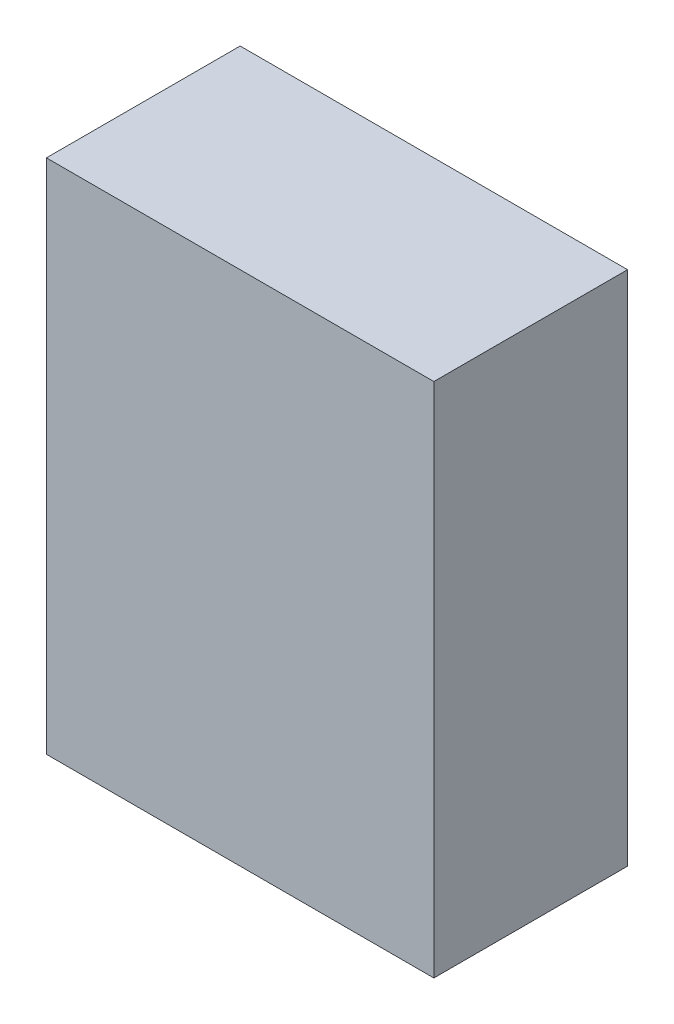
from build123d import *

# Parameters (mm, degrees)
SKETCH1_W      = 76.2
SKETCH1_H      = 101.6
EXTRUDE1_DEPTH = 38.1


with BuildPart() as part:
    # Sketch1 → Extrude1 (new body)
    with BuildSketch(Plane.XY):
        with Locations((38.1, 50.8)):
            Rectangle(SKETCH1_W, SKETCH1_H)
    extrude(amount=EXTRUDE1_DEPTH)


solid = part.part
